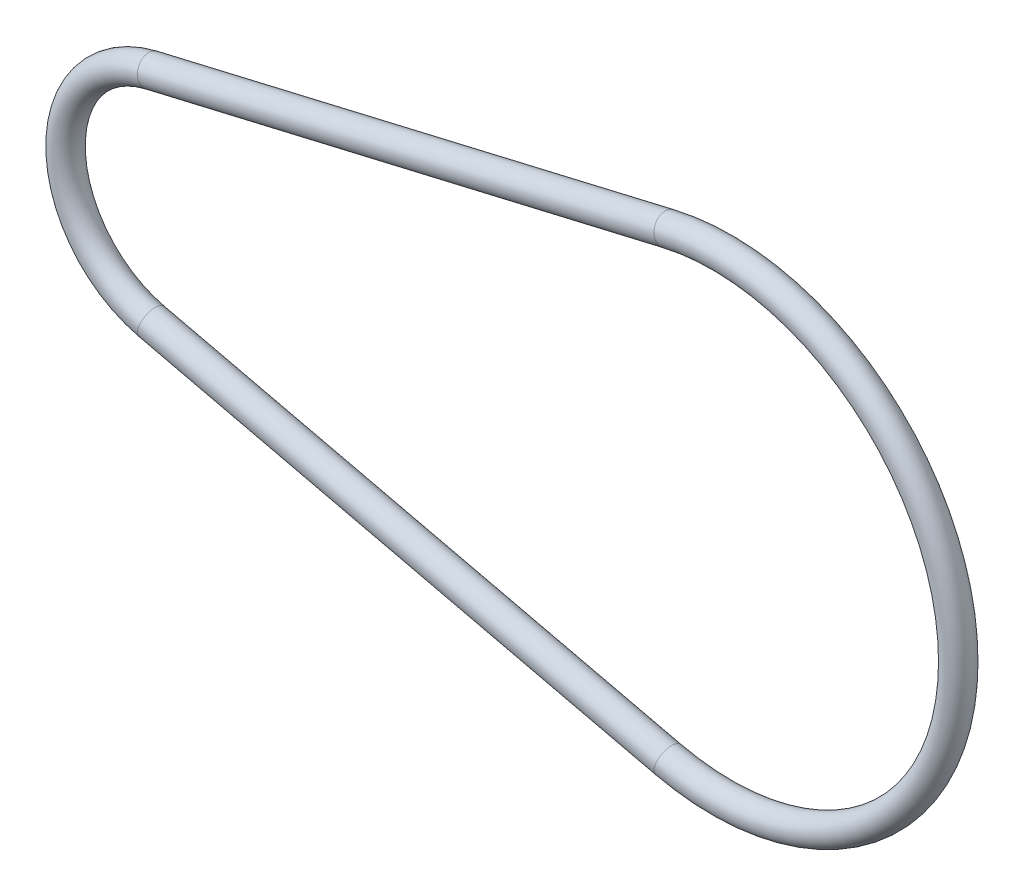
ISO-10303-21;
HEADER;
FILE_DESCRIPTION(('STEP AP214'),'2;1');
FILE_NAME('part.step','',(''),(''),'','','');
FILE_SCHEMA(('AUTOMOTIVE_DESIGN { 1 0 10303 214 1 1 1 1 }'));
ENDSEC;
DATA;
#1=APPLICATION_CONTEXT('core data for automotive mechanical design processes');
#2=APPLICATION_PROTOCOL_DEFINITION('international standard','automotive_design',2000,#1);
#3=PRODUCT_CONTEXT('',#1,'mechanical');
#4=PRODUCT('Part','Part','',(#3));
#5=PRODUCT_RELATED_PRODUCT_CATEGORY('part','',(#4));
#6=PRODUCT_DEFINITION_FORMATION('','',#4);
#7=PRODUCT_DEFINITION_CONTEXT('part definition',#1,'design');
#8=PRODUCT_DEFINITION('design','',#6,#7);
#9=PRODUCT_DEFINITION_SHAPE('','',#8);
#10=(LENGTH_UNIT() NAMED_UNIT(*) SI_UNIT(.MILLI.,.METRE.));
#11=(NAMED_UNIT(*) PLANE_ANGLE_UNIT() SI_UNIT($,.RADIAN.));
#12=(NAMED_UNIT(*) SI_UNIT($,.STERADIAN.) SOLID_ANGLE_UNIT());
#13=UNCERTAINTY_MEASURE_WITH_UNIT(LENGTH_MEASURE(1.E-05),#10,'distance_accuracy_value','');
#14=(GEOMETRIC_REPRESENTATION_CONTEXT(3) GLOBAL_UNCERTAINTY_ASSIGNED_CONTEXT((#13)) GLOBAL_UNIT_ASSIGNED_CONTEXT((#10,
#11,#12)) REPRESENTATION_CONTEXT('',''));
#15=CARTESIAN_POINT('',(0.,0.,0.));
#16=DIRECTION('',(0.,0.,1.));
#17=DIRECTION('',(1.,0.,0.));
#18=AXIS2_PLACEMENT_3D('',#15,#16,#17);
#19=CARTESIAN_POINT('',(-1.82564102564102,-7.78890459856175,0.));
#20=DIRECTION('',(0.973613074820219,-0.228205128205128,0.));
#21=DIRECTION('',(0.228205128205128,0.973613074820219,0.));
#22=AXIS2_PLACEMENT_3D('',#19,#20,#21);
#23=CYLINDRICAL_SURFACE('',#22,0.999999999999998);
#24=CARTESIAN_POINT('',(-1.82564102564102,-7.78890459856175,0.));
#25=DIRECTION('',(0.973613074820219,-0.228205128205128,0.));
#26=DIRECTION('',(0.,0.,1.));
#27=AXIS2_PLACEMENT_3D('',#24,#25,#26);
#28=CIRCLE('',#27,0.999999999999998);
#29=CARTESIAN_POINT('',(-2.05384615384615,-8.76251767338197,0.));
#30=VERTEX_POINT('',#29);
#31=EDGE_CURVE('E30',#30,#30,#28,.T.);
#32=ORIENTED_EDGE('',*,*,#31,.T.);
#33=EDGE_LOOP('',(#32));
#34=FACE_BOUND('',#33,.T.);
#35=CARTESIAN_POINT('',(35.1433333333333,-16.4540609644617,0.));
#36=DIRECTION('',(0.973613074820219,-0.228205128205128,0.));
#37=DIRECTION('',(0.,0.,1.));
#38=AXIS2_PLACEMENT_3D('',#35,#36,#37);
#39=CIRCLE('',#38,0.999999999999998);
#40=CARTESIAN_POINT('',(34.9151282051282,-17.4276740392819,0.));
#41=VERTEX_POINT('',#40);
#42=EDGE_CURVE('E10',#41,#41,#39,.T.);
#43=ORIENTED_EDGE('',*,*,#42,.F.);
#44=EDGE_LOOP('',(#43));
#45=FACE_BOUND('',#44,.T.);
#46=ADVANCED_FACE('F24',(#34,#45),#23,.T.);
#47=CARTESIAN_POINT('',(0.,0.,0.));
#48=DIRECTION('',(0.,0.,1.));
#49=DIRECTION('',(1.,0.,0.));
#50=AXIS2_PLACEMENT_3D('',#47,#48,#49);
#51=TOROIDAL_SURFACE('',#50,8.,0.999999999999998);
#52=CARTESIAN_POINT('',(-1.82564102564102,7.78890459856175,0.));
#53=DIRECTION('',(-0.973613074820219,-0.228205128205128,0.));
#54=DIRECTION('',(0.,0.,1.));
#55=AXIS2_PLACEMENT_3D('',#52,#53,#54);
#56=CIRCLE('',#55,0.999999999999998);
#57=CARTESIAN_POINT('',(-2.05384615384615,8.76251767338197,0.));
#58=VERTEX_POINT('',#57);
#59=EDGE_CURVE('E34',#58,#58,#56,.T.);
#60=CARTESIAN_POINT('',(0.,0.,0.));
#61=DIRECTION('',(0.,0.,1.));
#62=DIRECTION('',(1.,0.,0.));
#63=AXIS2_PLACEMENT_3D('',#60,#61,#62);
#64=CIRCLE('',#63,8.99999999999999);
#65=EDGE_CURVE('',#58,#30,#64,.T.);
#66=ORIENTED_EDGE('',*,*,#59,.T.);
#67=ORIENTED_EDGE('',*,*,#31,.F.);
#68=ORIENTED_EDGE('',*,*,#65,.T.);
#69=ORIENTED_EDGE('',*,*,#65,.F.);
#70=EDGE_LOOP('',(#66,#68,#67,#69));
#71=FACE_BOUND('',#70,.T.);
#72=ADVANCED_FACE('F53',(#71),#51,.T.);
#73=CARTESIAN_POINT('',(35.1433333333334,16.4540609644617,0.));
#74=DIRECTION('',(-0.973613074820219,-0.228205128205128,0.));
#75=DIRECTION('',(0.228205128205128,-0.973613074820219,0.));
#76=AXIS2_PLACEMENT_3D('',#73,#74,#75);
#77=CYLINDRICAL_SURFACE('',#76,0.999999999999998);
#78=CARTESIAN_POINT('',(35.1433333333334,16.4540609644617,0.));
#79=DIRECTION('',(-0.973613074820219,-0.228205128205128,0.));
#80=DIRECTION('',(0.,0.,1.));
#81=AXIS2_PLACEMENT_3D('',#78,#79,#80);
#82=CIRCLE('',#81,0.999999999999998);
#83=CARTESIAN_POINT('',(34.9151282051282,17.4276740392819,0.));
#84=VERTEX_POINT('',#83);
#85=EDGE_CURVE('E38',#84,#84,#82,.T.);
#86=ORIENTED_EDGE('',*,*,#85,.T.);
#87=EDGE_LOOP('',(#86));
#88=FACE_BOUND('',#87,.T.);
#89=ORIENTED_EDGE('',*,*,#59,.F.);
#90=EDGE_LOOP('',(#89));
#91=FACE_BOUND('',#90,.T.);
#92=ADVANCED_FACE('F44',(#88,#91),#77,.T.);
#93=CARTESIAN_POINT('',(39.,0.,0.));
#94=DIRECTION('',(0.,0.,-1.));
#95=DIRECTION('',(-1.,0.,0.));
#96=AXIS2_PLACEMENT_3D('',#93,#94,#95);
#97=TOROIDAL_SURFACE('',#96,16.9,0.999999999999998);
#98=CARTESIAN_POINT('',(39.,0.,0.));
#99=DIRECTION('',(0.,0.,-1.));
#100=DIRECTION('',(-1.,0.,0.));
#101=AXIS2_PLACEMENT_3D('',#98,#99,#100);
#102=CIRCLE('',#101,17.9);
#103=EDGE_CURVE('',#84,#41,#102,.T.);
#104=ORIENTED_EDGE('',*,*,#85,.F.);
#105=ORIENTED_EDGE('',*,*,#42,.T.);
#106=ORIENTED_EDGE('',*,*,#103,.T.);
#107=ORIENTED_EDGE('',*,*,#103,.F.);
#108=EDGE_LOOP('',(#104,#106,#105,#107));
#109=FACE_BOUND('',#108,.T.);
#110=ADVANCED_FACE('F47',(#109),#97,.T.);
#111=CLOSED_SHELL('',(#46,#72,#92,#110));
#112=MANIFOLD_SOLID_BREP('B2',#111);
#113=ADVANCED_BREP_SHAPE_REPRESENTATION('',(#18,#112),#14);
#114=SHAPE_DEFINITION_REPRESENTATION(#9,#113);
ENDSEC;
END-ISO-10303-21;
